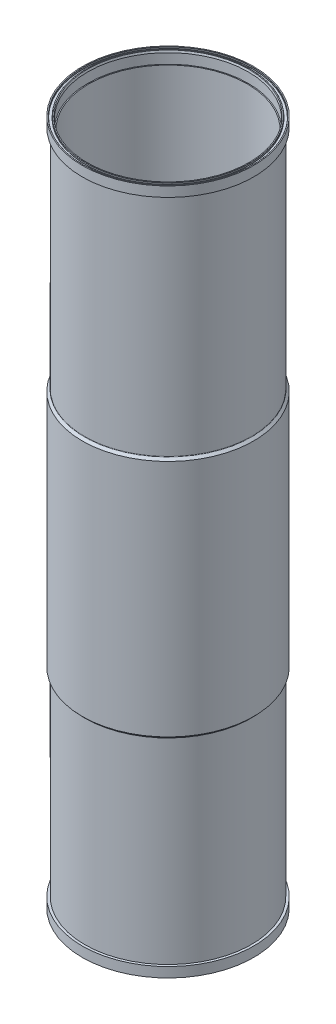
from build123d import *

# Parameters (mm, degrees)
SKETCH4_W = 3.0988
SKETCH4_H = 850.9


with BuildPart() as part:
    # Sketch1 → Revolve1 (revolve)
    with BuildSketch(Plane.XY, mode=Mode.PRIVATE) as revolve1_sk:
        Polygon((-109.5375, 876.3), (-103.309290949, 876.3), (-102.6287, 873.76), (-102.6287, 861.06), (-101.3587, 861.06), (-101.3587, 15.24), (-102.6287, 15.24), (-102.6287, 2.54), (-103.309290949, 0), (-109.5375, 0), align=None)
    revolve(revolve1_sk.sketch.rotate(Axis((0, 0, 0), (0, 1, 0)), 270), axis=Axis((0, 0, 0), (0, 1, 0)))

    # Sketch4 → Cut-Revolve2 (revolve, cut)
    with BuildSketch(Plane.XY, mode=Mode.PRIVATE) as cut_revolve2_sk:
        with Locations((-107.9881, 438.15)):
            Rectangle(SKETCH4_W, SKETCH4_H)
    revolve(cut_revolve2_sk.sketch.rotate(Axis((0, 880.11, 0), (0, -1, 0)), 90), axis=Axis((0, 880.11, 0), (0, -1, 0)), mode=Mode.SUBTRACT)

    # Sketch5 → 2-172 O-Ring (revolve, cut)
    with BuildSketch(Plane.XY, mode=Mode.PRIVATE) as f_2_172_o_ring_sk:
        with BuildLine():
            Line((-108.2675, 876.3), (-104.4829, 876.3))
            ThreePointArc((-104.4829, 876.3), (-104.572702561, 876.262802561), (-104.6099, 876.173))
            Line((-104.6099, 876.173), (-104.6099, 874.5982))
            ThreePointArc((-104.6099, 874.5982), (-104.684294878, 874.418594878), (-104.8639, 874.3442))
            Line((-104.8639, 874.3442), (-107.8865, 874.3442))
            ThreePointArc((-107.8865, 874.3442), (-108.066105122, 874.418594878), (-108.1405, 874.5982))
            Line((-108.1405, 874.5982), (-108.1405, 876.173))
            ThreePointArc((-108.1405, 876.173), (-108.177697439, 876.262802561), (-108.2675, 876.3))
        make_face()
    f_2_172_o_ring = revolve(f_2_172_o_ring_sk.sketch.rotate(Axis((0, 0, 0), (0, 1, 0)), 270), axis=Axis((0, 0, 0), (0, 1, 0)), mode=Mode.SUBTRACT)

    # Mirror1: 2-172 O-Ring across plane
    add(f_2_172_o_ring.mirror(Plane.ZX.offset(438.15)), mode=Mode.SUBTRACT)

    # Sketch8 → Revolve2 (revolve)
    with BuildSketch(Plane.XY, mode=Mode.PRIVATE) as revolve2_sk:
        with BuildLine():
            Line((-109.5375, 266.7), (-106.671183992, 263.833683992))
            ThreePointArc((-106.671183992, 263.833683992), (-106.499120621, 263.576172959), (-106.4387, 263.272417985))
            Line((-106.4387, 263.272417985), (-106.4387, 574.927582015))
            ThreePointArc((-106.4387, 574.927582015), (-106.499120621, 574.623827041), (-106.671183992, 574.366316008))
            Line((-106.671183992, 574.366316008), (-109.5375, 571.5))
            Line((-109.5375, 571.5), (-109.5375, 266.7))
        make_face()
    revolve(revolve2_sk.sketch.rotate(Axis((0, 0, 0), (0, 1, 0)), 270), axis=Axis((0, 0, 0), (0, 1, 0)))


solid = part.part
